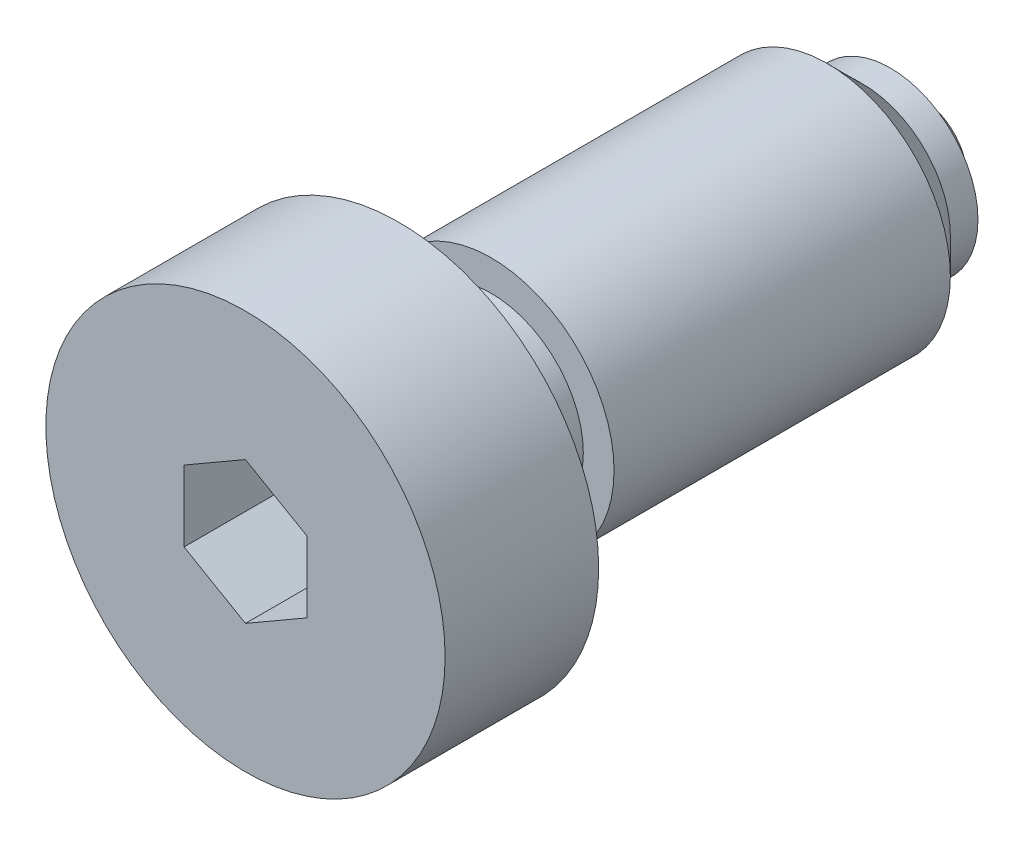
ISO-10303-21;
HEADER;
FILE_DESCRIPTION(('STEP AP214'),'2;1');
FILE_NAME('part.step','',(''),(''),'','','');
FILE_SCHEMA(('AUTOMOTIVE_DESIGN { 1 0 10303 214 1 1 1 1 }'));
ENDSEC;
DATA;
#1=APPLICATION_CONTEXT('core data for automotive mechanical design processes');
#2=APPLICATION_PROTOCOL_DEFINITION('international standard','automotive_design',2000,#1);
#3=PRODUCT_CONTEXT('',#1,'mechanical');
#4=PRODUCT('Part','Part','',(#3));
#5=PRODUCT_RELATED_PRODUCT_CATEGORY('part','',(#4));
#6=PRODUCT_DEFINITION_FORMATION('','',#4);
#7=PRODUCT_DEFINITION_CONTEXT('part definition',#1,'design');
#8=PRODUCT_DEFINITION('design','',#6,#7);
#9=PRODUCT_DEFINITION_SHAPE('','',#8);
#10=(LENGTH_UNIT() NAMED_UNIT(*) SI_UNIT(.MILLI.,.METRE.));
#11=(NAMED_UNIT(*) PLANE_ANGLE_UNIT() SI_UNIT($,.RADIAN.));
#12=(NAMED_UNIT(*) SI_UNIT($,.STERADIAN.) SOLID_ANGLE_UNIT());
#13=UNCERTAINTY_MEASURE_WITH_UNIT(LENGTH_MEASURE(1.E-05),#10,'distance_accuracy_value','');
#14=(GEOMETRIC_REPRESENTATION_CONTEXT(3) GLOBAL_UNCERTAINTY_ASSIGNED_CONTEXT((#13)) GLOBAL_UNIT_ASSIGNED_CONTEXT((#10,
#11,#12)) REPRESENTATION_CONTEXT('',''));
#15=CARTESIAN_POINT('',(0.,0.,0.));
#16=DIRECTION('',(0.,0.,1.));
#17=DIRECTION('',(1.,0.,0.));
#18=AXIS2_PLACEMENT_3D('',#15,#16,#17);
#19=CARTESIAN_POINT('',(0.,0.,19.5318271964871));
#20=DIRECTION('',(0.,0.,1.));
#21=DIRECTION('',(1.,0.,0.));
#22=AXIS2_PLACEMENT_3D('',#19,#20,#21);
#23=CYLINDRICAL_SURFACE('',#22,6.5);
#24=CARTESIAN_POINT('',(0.,0.,17.5));
#25=DIRECTION('',(0.,0.,1.));
#26=DIRECTION('',(1.,0.,0.));
#27=AXIS2_PLACEMENT_3D('',#24,#25,#26);
#28=CIRCLE('',#27,6.5);
#29=CARTESIAN_POINT('',(6.5,0.,17.5));
#30=VERTEX_POINT('',#29);
#31=EDGE_CURVE('E9',#30,#30,#28,.T.);
#32=ORIENTED_EDGE('',*,*,#31,.T.);
#33=EDGE_LOOP('',(#32));
#34=FACE_BOUND('',#33,.T.);
#35=CARTESIAN_POINT('',(0.,0.,22.5));
#36=DIRECTION('',(0.,0.,1.));
#37=DIRECTION('',(1.,0.,0.));
#38=AXIS2_PLACEMENT_3D('',#35,#36,#37);
#39=CIRCLE('',#38,6.5);
#40=CARTESIAN_POINT('',(6.5,0.,22.5));
#41=VERTEX_POINT('',#40);
#42=EDGE_CURVE('E116',#41,#41,#39,.T.);
#43=ORIENTED_EDGE('',*,*,#42,.F.);
#44=EDGE_LOOP('',(#43));
#45=FACE_BOUND('',#44,.T.);
#46=ADVANCED_FACE('F14',(#34,#45),#23,.T.);
#47=CARTESIAN_POINT('',(3.,0.,17.5));
#48=DIRECTION('',(0.,0.,-1.));
#49=DIRECTION('',(-1.,0.,0.));
#50=AXIS2_PLACEMENT_3D('',#47,#48,#49);
#51=PLANE('',#50);
#52=CARTESIAN_POINT('',(0.,0.,17.5));
#53=DIRECTION('',(0.,0.,1.));
#54=DIRECTION('',(1.,0.,0.));
#55=AXIS2_PLACEMENT_3D('',#52,#53,#54);
#56=CIRCLE('',#55,3.);
#57=CARTESIAN_POINT('',(3.,0.,17.5));
#58=VERTEX_POINT('',#57);
#59=EDGE_CURVE('E21',#58,#58,#56,.T.);
#60=ORIENTED_EDGE('',*,*,#59,.T.);
#61=EDGE_LOOP('',(#60));
#62=FACE_BOUND('',#61,.T.);
#63=ORIENTED_EDGE('',*,*,#31,.F.);
#64=EDGE_LOOP('',(#63));
#65=FACE_BOUND('',#64,.T.);
#66=ADVANCED_FACE('F145',(#62,#65),#51,.T.);
#67=CARTESIAN_POINT('',(0.,0.,19.5318271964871));
#68=DIRECTION('',(0.,0.,1.));
#69=DIRECTION('',(1.,0.,0.));
#70=AXIS2_PLACEMENT_3D('',#67,#68,#69);
#71=CYLINDRICAL_SURFACE('',#70,3.);
#72=CARTESIAN_POINT('',(0.,0.,14.5));
#73=DIRECTION('',(0.,0.,1.));
#74=DIRECTION('',(1.,0.,0.));
#75=AXIS2_PLACEMENT_3D('',#72,#73,#74);
#76=CIRCLE('',#75,3.);
#77=CARTESIAN_POINT('',(3.,0.,14.5));
#78=VERTEX_POINT('',#77);
#79=EDGE_CURVE('E140',#78,#78,#76,.T.);
#80=ORIENTED_EDGE('',*,*,#79,.T.);
#81=EDGE_LOOP('',(#80));
#82=FACE_BOUND('',#81,.T.);
#83=ORIENTED_EDGE('',*,*,#59,.F.);
#84=EDGE_LOOP('',(#83));
#85=FACE_BOUND('',#84,.T.);
#86=ADVANCED_FACE('F148',(#82,#85),#71,.T.);
#87=CARTESIAN_POINT('',(3.,0.,14.5));
#88=DIRECTION('',(0.,0.,1.));
#89=DIRECTION('',(1.,0.,0.));
#90=AXIS2_PLACEMENT_3D('',#87,#88,#89);
#91=PLANE('',#90);
#92=CARTESIAN_POINT('',(0.,0.,14.5));
#93=DIRECTION('',(0.,0.,1.));
#94=DIRECTION('',(1.,0.,0.));
#95=AXIS2_PLACEMENT_3D('',#92,#93,#94);
#96=CIRCLE('',#95,4.);
#97=CARTESIAN_POINT('',(4.,0.,14.5));
#98=VERTEX_POINT('',#97);
#99=EDGE_CURVE('E137',#98,#98,#96,.T.);
#100=ORIENTED_EDGE('',*,*,#99,.T.);
#101=EDGE_LOOP('',(#100));
#102=FACE_BOUND('',#101,.T.);
#103=ORIENTED_EDGE('',*,*,#79,.F.);
#104=EDGE_LOOP('',(#103));
#105=FACE_BOUND('',#104,.T.);
#106=ADVANCED_FACE('F150',(#102,#105),#91,.T.);
#107=CARTESIAN_POINT('',(0.,0.,19.5318271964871));
#108=DIRECTION('',(0.,0.,1.));
#109=DIRECTION('',(1.,0.,0.));
#110=AXIS2_PLACEMENT_3D('',#107,#108,#109);
#111=CYLINDRICAL_SURFACE('',#110,4.);
#112=CARTESIAN_POINT('',(0.,0.,3.55));
#113=DIRECTION('',(0.,0.,1.));
#114=DIRECTION('',(1.,0.,0.));
#115=AXIS2_PLACEMENT_3D('',#112,#113,#114);
#116=CIRCLE('',#115,4.);
#117=CARTESIAN_POINT('',(4.,0.,3.55));
#118=VERTEX_POINT('',#117);
#119=EDGE_CURVE('E134',#118,#118,#116,.T.);
#120=ORIENTED_EDGE('',*,*,#119,.T.);
#121=EDGE_LOOP('',(#120));
#122=FACE_BOUND('',#121,.T.);
#123=ORIENTED_EDGE('',*,*,#99,.F.);
#124=EDGE_LOOP('',(#123));
#125=FACE_BOUND('',#124,.T.);
#126=ADVANCED_FACE('F158',(#122,#125),#111,.T.);
#127=CARTESIAN_POINT('',(0.,0.,3.55));
#128=DIRECTION('',(0.,0.,1.));
#129=DIRECTION('',(1.,0.,0.));
#130=AXIS2_PLACEMENT_3D('',#127,#128,#129);
#131=CONICAL_SURFACE('',#130,4.,0.785398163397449);
#132=CARTESIAN_POINT('',(0.,0.,2.4));
#133=DIRECTION('',(0.,0.,1.));
#134=DIRECTION('',(1.,0.,0.));
#135=AXIS2_PLACEMENT_3D('',#132,#133,#134);
#136=CIRCLE('',#135,2.85);
#137=CARTESIAN_POINT('',(2.85,0.,2.4));
#138=VERTEX_POINT('',#137);
#139=EDGE_CURVE('E131',#138,#138,#136,.T.);
#140=ORIENTED_EDGE('',*,*,#139,.T.);
#141=EDGE_LOOP('',(#140));
#142=FACE_BOUND('',#141,.T.);
#143=ORIENTED_EDGE('',*,*,#119,.F.);
#144=EDGE_LOOP('',(#143));
#145=FACE_BOUND('',#144,.T.);
#146=ADVANCED_FACE('F189',(#142,#145),#131,.T.);
#147=CARTESIAN_POINT('',(0.,0.,19.5318271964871));
#148=DIRECTION('',(0.,0.,1.));
#149=DIRECTION('',(1.,0.,0.));
#150=AXIS2_PLACEMENT_3D('',#147,#148,#149);
#151=CYLINDRICAL_SURFACE('',#150,2.85);
#152=CARTESIAN_POINT('',(0.,0.,1.5));
#153=DIRECTION('',(0.,0.,1.));
#154=DIRECTION('',(1.,0.,0.));
#155=AXIS2_PLACEMENT_3D('',#152,#153,#154);
#156=CIRCLE('',#155,2.85);
#157=CARTESIAN_POINT('',(2.85,0.,1.5));
#158=VERTEX_POINT('',#157);
#159=EDGE_CURVE('E128',#158,#158,#156,.T.);
#160=ORIENTED_EDGE('',*,*,#159,.T.);
#161=EDGE_LOOP('',(#160));
#162=FACE_BOUND('',#161,.T.);
#163=ORIENTED_EDGE('',*,*,#139,.F.);
#164=EDGE_LOOP('',(#163));
#165=FACE_BOUND('',#164,.T.);
#166=ADVANCED_FACE('F185',(#162,#165),#151,.T.);
#167=CARTESIAN_POINT('',(2.85,0.,1.5));
#168=DIRECTION('',(0.,0.,-1.));
#169=DIRECTION('',(-1.,0.,0.));
#170=AXIS2_PLACEMENT_3D('',#167,#168,#169);
#171=PLANE('',#170);
#172=CARTESIAN_POINT('',(0.,0.,1.5));
#173=DIRECTION('',(0.,0.,1.));
#174=DIRECTION('',(1.,0.,0.));
#175=AXIS2_PLACEMENT_3D('',#172,#173,#174);
#176=CIRCLE('',#175,2.29128784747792);
#177=CARTESIAN_POINT('',(2.29128784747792,0.,1.5));
#178=VERTEX_POINT('',#177);
#179=EDGE_CURVE('E125',#178,#178,#176,.T.);
#180=ORIENTED_EDGE('',*,*,#179,.T.);
#181=EDGE_LOOP('',(#180));
#182=FACE_BOUND('',#181,.T.);
#183=ORIENTED_EDGE('',*,*,#159,.F.);
#184=EDGE_LOOP('',(#183));
#185=FACE_BOUND('',#184,.T.);
#186=ADVANCED_FACE('F178',(#182,#185),#171,.T.);
#187=CARTESIAN_POINT('',(0.,0.,2.5));
#188=DIRECTION('',(0.,0.,1.));
#189=DIRECTION('',(1.,0.,0.));
#190=AXIS2_PLACEMENT_3D('',#187,#188,#189);
#191=SPHERICAL_SURFACE('',#190,2.5);
#192=ORIENTED_EDGE('',*,*,#179,.F.);
#193=EDGE_LOOP('',(#192));
#194=FACE_BOUND('',#193,.T.);
#195=ADVANCED_FACE('F170',(#194),#191,.T.);
#196=CARTESIAN_POINT('',(6.5,0.,22.5));
#197=DIRECTION('',(0.,0.,1.));
#198=DIRECTION('',(1.,0.,0.));
#199=AXIS2_PLACEMENT_3D('',#196,#197,#198);
#200=PLANE('',#199);
#201=DIRECTION('',(-0.866025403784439,0.5,0.));
#202=VECTOR('',#201,1.);
#203=CARTESIAN_POINT('',(2.,1.15470053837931,22.5));
#204=LINE('',#203,#202);
#205=CARTESIAN_POINT('',(2.,1.15470053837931,22.5));
#206=VERTEX_POINT('',#205);
#207=CARTESIAN_POINT('',(0.,2.30940107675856,22.5));
#208=VERTEX_POINT('',#207);
#209=EDGE_CURVE('E28',#206,#208,#204,.T.);
#210=ORIENTED_EDGE('',*,*,#209,.F.);
#211=DIRECTION('',(0.,1.,0.));
#212=VECTOR('',#211,1.);
#213=CARTESIAN_POINT('',(2.,-1.15470053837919,22.5));
#214=LINE('',#213,#212);
#215=CARTESIAN_POINT('',(2.,-1.15470053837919,22.5));
#216=VERTEX_POINT('',#215);
#217=EDGE_CURVE('E98',#216,#206,#214,.T.);
#218=ORIENTED_EDGE('',*,*,#217,.F.);
#219=DIRECTION('',(0.866025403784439,0.5,0.));
#220=VECTOR('',#219,1.);
#221=CARTESIAN_POINT('',(0.,-2.30940107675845,22.5));
#222=LINE('',#221,#220);
#223=CARTESIAN_POINT('',(0.,-2.30940107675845,22.5));
#224=VERTEX_POINT('',#223);
#225=EDGE_CURVE('E92',#224,#216,#222,.T.);
#226=ORIENTED_EDGE('',*,*,#225,.F.);
#227=DIRECTION('',(0.866025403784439,-0.5,0.));
#228=VECTOR('',#227,1.);
#229=CARTESIAN_POINT('',(-2.,-1.15470053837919,22.5));
#230=LINE('',#229,#228);
#231=CARTESIAN_POINT('',(-2.,-1.15470053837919,22.5));
#232=VERTEX_POINT('',#231);
#233=EDGE_CURVE('E90',#232,#224,#230,.T.);
#234=ORIENTED_EDGE('',*,*,#233,.F.);
#235=DIRECTION('',(0.,-1.,0.));
#236=VECTOR('',#235,1.);
#237=CARTESIAN_POINT('',(-2.,1.15470053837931,22.5));
#238=LINE('',#237,#236);
#239=CARTESIAN_POINT('',(-2.,1.15470053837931,22.5));
#240=VERTEX_POINT('',#239);
#241=EDGE_CURVE('E71',#240,#232,#238,.T.);
#242=ORIENTED_EDGE('',*,*,#241,.F.);
#243=DIRECTION('',(-0.866025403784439,-0.5,0.));
#244=VECTOR('',#243,1.);
#245=CARTESIAN_POINT('',(0.,2.30940107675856,22.5));
#246=LINE('',#245,#244);
#247=EDGE_CURVE('E82',#208,#240,#246,.T.);
#248=ORIENTED_EDGE('',*,*,#247,.F.);
#249=EDGE_LOOP('',(#210,#218,#226,#234,#242,#248));
#250=FACE_BOUND('',#249,.T.);
#251=ORIENTED_EDGE('',*,*,#42,.T.);
#252=EDGE_LOOP('',(#251));
#253=FACE_BOUND('',#252,.T.);
#254=ADVANCED_FACE('F86',(#250,#253),#200,.T.);
#255=CARTESIAN_POINT('',(2.,1.15470053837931,19.));
#256=DIRECTION('',(0.5,0.866025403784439,0.));
#257=DIRECTION('',(0.866025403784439,-0.5,0.));
#258=AXIS2_PLACEMENT_3D('',#255,#256,#257);
#259=PLANE('',#258);
#260=ORIENTED_EDGE('',*,*,#209,.T.);
#261=DIRECTION('',(0.,0.,1.));
#262=VECTOR('',#261,1.);
#263=CARTESIAN_POINT('',(0.,2.30940107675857,19.));
#264=LINE('',#263,#262);
#265=CARTESIAN_POINT('',(0.,2.30940107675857,19.));
#266=VERTEX_POINT('',#265);
#267=EDGE_CURVE('E79',#266,#208,#264,.T.);
#268=ORIENTED_EDGE('',*,*,#267,.F.);
#269=DIRECTION('',(-0.866025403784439,0.5,0.));
#270=VECTOR('',#269,1.);
#271=CARTESIAN_POINT('',(2.,1.15470053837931,19.));
#272=LINE('',#271,#270);
#273=CARTESIAN_POINT('',(2.,1.15470053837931,19.));
#274=VERTEX_POINT('',#273);
#275=EDGE_CURVE('E100',#274,#266,#272,.T.);
#276=ORIENTED_EDGE('',*,*,#275,.F.);
#277=DIRECTION('',(0.,0.,1.));
#278=VECTOR('',#277,1.);
#279=CARTESIAN_POINT('',(2.,1.15470053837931,19.));
#280=LINE('',#279,#278);
#281=EDGE_CURVE('E35',#274,#206,#280,.T.);
#282=ORIENTED_EDGE('',*,*,#281,.T.);
#283=EDGE_LOOP('',(#260,#268,#276,#282));
#284=FACE_BOUND('',#283,.T.);
#285=ADVANCED_FACE('F169',(#284),#259,.F.);
#286=CARTESIAN_POINT('',(2.,-1.15470053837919,19.));
#287=DIRECTION('',(1.,0.,0.));
#288=DIRECTION('',(0.,0.,1.));
#289=AXIS2_PLACEMENT_3D('',#286,#287,#288);
#290=PLANE('',#289);
#291=ORIENTED_EDGE('',*,*,#217,.T.);
#292=ORIENTED_EDGE('',*,*,#281,.F.);
#293=DIRECTION('',(0.,1.,0.));
#294=VECTOR('',#293,1.);
#295=CARTESIAN_POINT('',(2.,-1.15470053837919,19.));
#296=LINE('',#295,#294);
#297=CARTESIAN_POINT('',(2.,-1.15470053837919,19.));
#298=VERTEX_POINT('',#297);
#299=EDGE_CURVE('E112',#298,#274,#296,.T.);
#300=ORIENTED_EDGE('',*,*,#299,.F.);
#301=DIRECTION('',(0.,0.,1.));
#302=VECTOR('',#301,1.);
#303=CARTESIAN_POINT('',(2.,-1.15470053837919,19.));
#304=LINE('',#303,#302);
#305=EDGE_CURVE('E117',#298,#216,#304,.T.);
#306=ORIENTED_EDGE('',*,*,#305,.T.);
#307=EDGE_LOOP('',(#291,#292,#300,#306));
#308=FACE_BOUND('',#307,.T.);
#309=ADVANCED_FACE('F176',(#308),#290,.F.);
#310=CARTESIAN_POINT('',(0.,-2.30940107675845,19.));
#311=DIRECTION('',(0.5,-0.866025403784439,0.));
#312=DIRECTION('',(-0.866025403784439,-0.5,0.));
#313=AXIS2_PLACEMENT_3D('',#310,#311,#312);
#314=PLANE('',#313);
#315=ORIENTED_EDGE('',*,*,#225,.T.);
#316=ORIENTED_EDGE('',*,*,#305,.F.);
#317=DIRECTION('',(0.866025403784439,0.5,0.));
#318=VECTOR('',#317,1.);
#319=CARTESIAN_POINT('',(0.,-2.30940107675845,19.));
#320=LINE('',#319,#318);
#321=CARTESIAN_POINT('',(0.,-2.30940107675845,19.));
#322=VERTEX_POINT('',#321);
#323=EDGE_CURVE('E109',#322,#298,#320,.T.);
#324=ORIENTED_EDGE('',*,*,#323,.F.);
#325=DIRECTION('',(0.,0.,1.));
#326=VECTOR('',#325,1.);
#327=CARTESIAN_POINT('',(0.,-2.30940107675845,19.));
#328=LINE('',#327,#326);
#329=EDGE_CURVE('E119',#322,#224,#328,.T.);
#330=ORIENTED_EDGE('',*,*,#329,.T.);
#331=EDGE_LOOP('',(#315,#316,#324,#330));
#332=FACE_BOUND('',#331,.T.);
#333=ADVANCED_FACE('F252',(#332),#314,.F.);
#334=CARTESIAN_POINT('',(-2.,-1.15470053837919,19.));
#335=DIRECTION('',(-0.5,-0.866025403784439,0.));
#336=DIRECTION('',(-0.866025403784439,0.5,0.));
#337=AXIS2_PLACEMENT_3D('',#334,#335,#336);
#338=PLANE('',#337);
#339=ORIENTED_EDGE('',*,*,#233,.T.);
#340=ORIENTED_EDGE('',*,*,#329,.F.);
#341=DIRECTION('',(0.866025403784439,-0.5,0.));
#342=VECTOR('',#341,1.);
#343=CARTESIAN_POINT('',(-2.,-1.15470053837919,19.));
#344=LINE('',#343,#342);
#345=CARTESIAN_POINT('',(-2.,-1.15470053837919,19.));
#346=VERTEX_POINT('',#345);
#347=EDGE_CURVE('E106',#346,#322,#344,.T.);
#348=ORIENTED_EDGE('',*,*,#347,.F.);
#349=DIRECTION('',(0.,0.,1.));
#350=VECTOR('',#349,1.);
#351=CARTESIAN_POINT('',(-2.,-1.15470053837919,19.));
#352=LINE('',#351,#350);
#353=EDGE_CURVE('E78',#346,#232,#352,.T.);
#354=ORIENTED_EDGE('',*,*,#353,.T.);
#355=EDGE_LOOP('',(#339,#340,#348,#354));
#356=FACE_BOUND('',#355,.T.);
#357=ADVANCED_FACE('F261',(#356),#338,.F.);
#358=CARTESIAN_POINT('',(-2.,1.15470053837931,19.));
#359=DIRECTION('',(-1.,0.,0.));
#360=DIRECTION('',(0.,1.,0.));
#361=AXIS2_PLACEMENT_3D('',#358,#359,#360);
#362=PLANE('',#361);
#363=ORIENTED_EDGE('',*,*,#241,.T.);
#364=ORIENTED_EDGE('',*,*,#353,.F.);
#365=DIRECTION('',(0.,-1.,0.));
#366=VECTOR('',#365,1.);
#367=CARTESIAN_POINT('',(-2.,1.15470053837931,19.));
#368=LINE('',#367,#366);
#369=CARTESIAN_POINT('',(-2.,1.15470053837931,19.));
#370=VERTEX_POINT('',#369);
#371=EDGE_CURVE('E74',#370,#346,#368,.T.);
#372=ORIENTED_EDGE('',*,*,#371,.F.);
#373=DIRECTION('',(0.,0.,1.));
#374=VECTOR('',#373,1.);
#375=CARTESIAN_POINT('',(-2.,1.15470053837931,19.));
#376=LINE('',#375,#374);
#377=EDGE_CURVE('E67',#370,#240,#376,.T.);
#378=ORIENTED_EDGE('',*,*,#377,.T.);
#379=EDGE_LOOP('',(#363,#364,#372,#378));
#380=FACE_BOUND('',#379,.T.);
#381=ADVANCED_FACE('F69',(#380),#362,.F.);
#382=CARTESIAN_POINT('',(0.,2.30940107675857,19.));
#383=DIRECTION('',(-0.5,0.866025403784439,0.));
#384=DIRECTION('',(0.866025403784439,0.5,0.));
#385=AXIS2_PLACEMENT_3D('',#382,#383,#384);
#386=PLANE('',#385);
#387=ORIENTED_EDGE('',*,*,#247,.T.);
#388=ORIENTED_EDGE('',*,*,#377,.F.);
#389=DIRECTION('',(-0.866025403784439,-0.5,0.));
#390=VECTOR('',#389,1.);
#391=CARTESIAN_POINT('',(0.,2.30940107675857,19.));
#392=LINE('',#391,#390);
#393=EDGE_CURVE('E103',#266,#370,#392,.T.);
#394=ORIENTED_EDGE('',*,*,#393,.F.);
#395=ORIENTED_EDGE('',*,*,#267,.T.);
#396=EDGE_LOOP('',(#387,#388,#394,#395));
#397=FACE_BOUND('',#396,.T.);
#398=ADVANCED_FACE('F83',(#397),#386,.F.);
#399=CARTESIAN_POINT('',(0.,2.30940107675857,19.));
#400=DIRECTION('',(0.,0.,1.));
#401=DIRECTION('',(0.,-1.,0.));
#402=AXIS2_PLACEMENT_3D('',#399,#400,#401);
#403=PLANE('',#402);
#404=ORIENTED_EDGE('',*,*,#275,.T.);
#405=ORIENTED_EDGE('',*,*,#393,.T.);
#406=ORIENTED_EDGE('',*,*,#371,.T.);
#407=ORIENTED_EDGE('',*,*,#347,.T.);
#408=ORIENTED_EDGE('',*,*,#323,.T.);
#409=ORIENTED_EDGE('',*,*,#299,.T.);
#410=EDGE_LOOP('',(#404,#405,#406,#407,#408,#409));
#411=FACE_BOUND('',#410,.T.);
#412=ADVANCED_FACE('F288',(#411),#403,.T.);
#413=CLOSED_SHELL('',(#46,#66,#86,#106,#126,#146,#166,#186,#195,#254,#285,#309,#333,#357,#381,
#398,#412));
#414=MANIFOLD_SOLID_BREP('B1',#413);
#415=ADVANCED_BREP_SHAPE_REPRESENTATION('',(#18,#414),#14);
#416=SHAPE_DEFINITION_REPRESENTATION(#9,#415);
ENDSEC;
END-ISO-10303-21;
